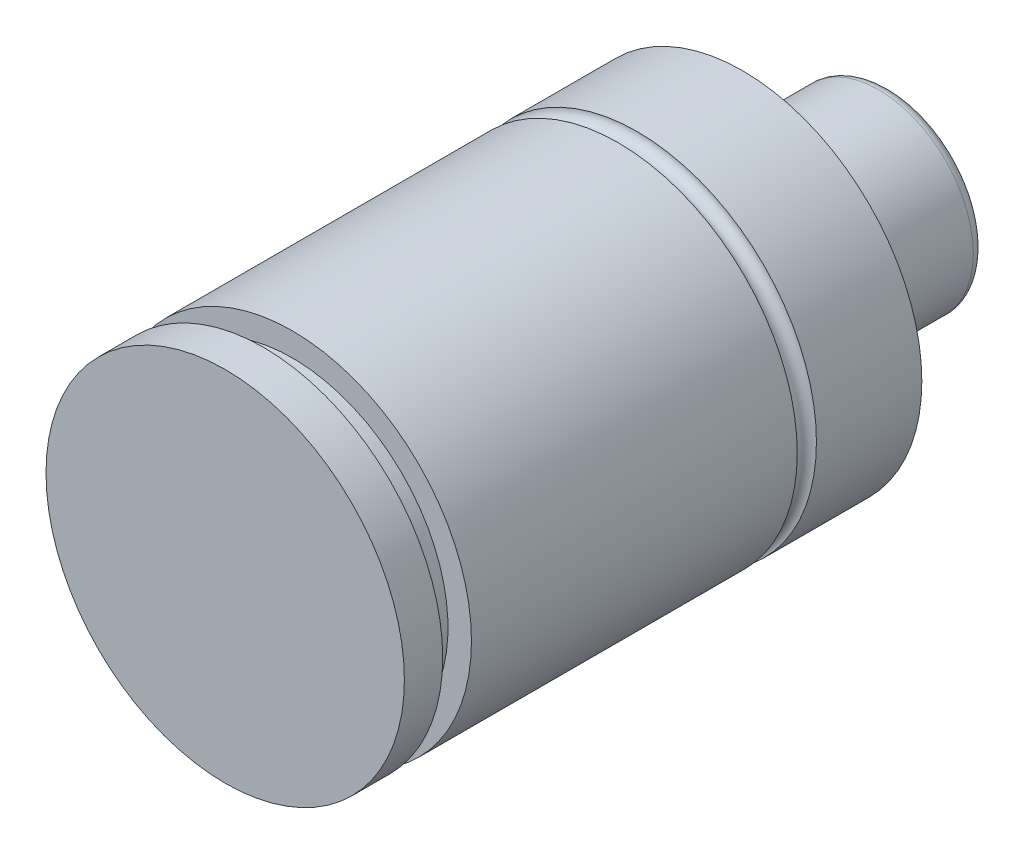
from build123d import *


with BuildPart() as part:
    # Logo3_bib1 → Revolve1 (revolve)
    with BuildSketch(Plane(origin=(0, 0, 0), x_dir=(-1, 0, 0), z_dir=(0, -1, 0))):
        with BuildLine():
            Line((0, 70.485), (0, 0))
            Line((0, 0), (18.9992, 0))
            Line((18.9992, 0), (18.9992, 4.064))
            Line((18.9992, 4.064), (16.51, 4.064))
            Line((16.51, 4.064), (16.51, 7.112))
            Line((16.51, 7.112), (18.9992, 7.112))
            Line((18.9992, 7.112), (18.9992, 41.656))
            ThreePointArc((18.9992, 41.656), (17.9832, 42.672), (18.9992, 43.688))
            Line((18.9992, 43.688), (18.9992, 54.864))
            Line((18.9992, 54.864), (10.033, 54.864))
            Line((10.033, 54.864), (10.033, 69.2912))
            ThreePointArc((10.033, 69.2912), (9.683344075, 70.135344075), (8.8392, 70.485))
            Line((8.8392, 70.485), (0, 70.485))
        make_face()
    revolve(axis=Axis((0, 0, -88.073796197), (0, 0, 1)))


solid = part.part
